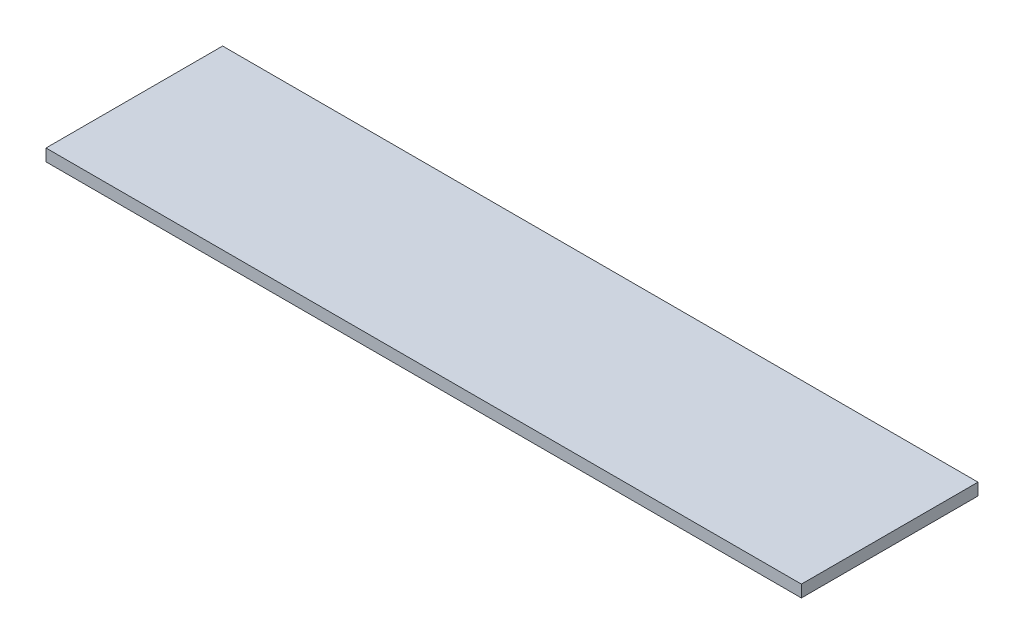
from build123d import *

# Parameters (mm, degrees)
SKETCH3_W           = 1197.564
SKETCH3_H           = 280
BOSS_EXTRUDE1_DEPTH = 19.05


with BuildPart() as part:
    # Sketch3 → Boss-Extrude1 (new body)
    with BuildSketch(Plane(origin=(0, 0, 0), x_dir=(-1, 0, 0), z_dir=(0, 1, 0))):
        Rectangle(SKETCH3_W, SKETCH3_H)
    extrude(amount=BOSS_EXTRUDE1_DEPTH)


solid = part.part
